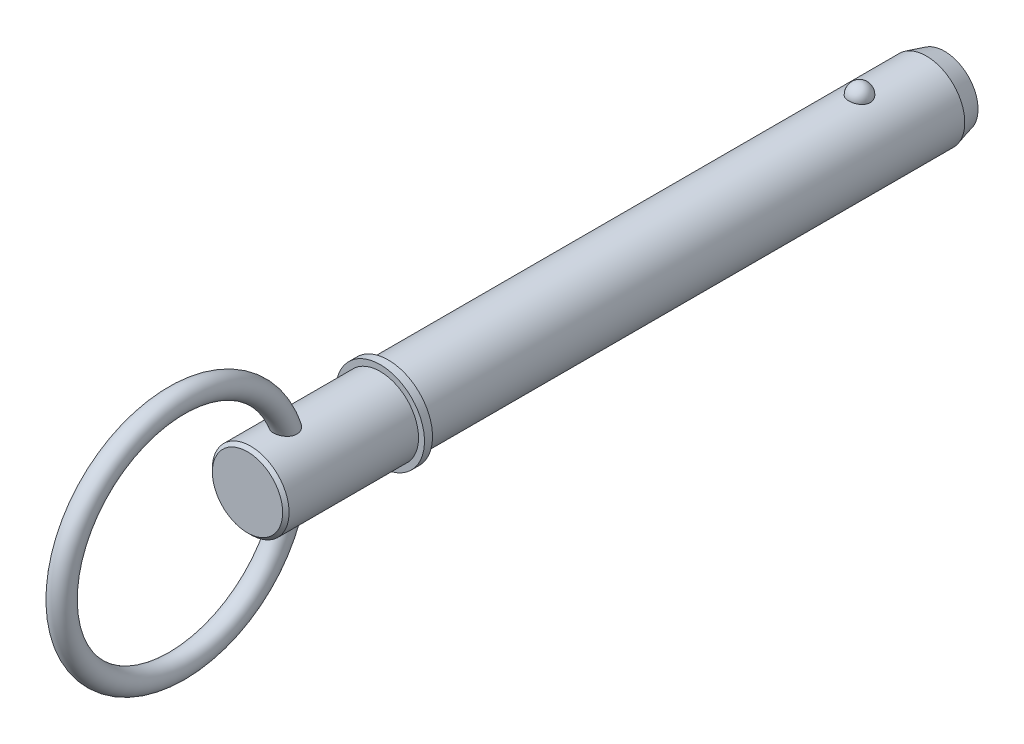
from build123d import *

# Parameters (mm, degrees)
SKETCH2_R           = 9.525
BOSS_EXTRUDE1_DEPTH = 114.3
BOSS_EXTRUDE2_START = 23.8
SKETCH3_R           = 9.525
BOSS_EXTRUDE2_DEPTH = 23.8
CHAMFER1_SIZE       = 4.5
CHAMFER1_SIZE2      = 1.205771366
SKETCH20_W          = 2
SKETCH20_H          = 11
SKETCH21_R          = 9.525
BOSS_EXTRUDE3_DEPTH = 34.93
CHAMFER2_SIZE       = 0.8
SKETCH24_R          = 2.75


with BuildPart() as part:
    # Sketch2 → Boss-Extrude1 (new body)
    with BuildSketch(Plane.XY):
        Circle(SKETCH2_R)
    extrude(amount=BOSS_EXTRUDE1_DEPTH)

    # Sketch3 → Boss-Extrude2 (add)
    with BuildSketch(Plane(origin=(0, 0, 0), x_dir=(-1, 0, 0), z_dir=(0, 0, -1)).offset(BOSS_EXTRUDE2_START)):
        Circle(SKETCH3_R)
    extrude(amount=-BOSS_EXTRUDE2_DEPTH)

    # Chamfer1
    chamfer1_edges = [part.edges().sort_by_distance(p)[0] for p in [
        (9.525, 0, -23.8),
    ]]
    chamfer1_side = [part.faces().sort_by_distance(p)[0] for p in [
        (9.525, 0, -11.9),
    ]]
    chamfer(chamfer1_edges, length=CHAMFER1_SIZE, length2=CHAMFER1_SIZE2, reference=chamfer1_side[0])

    # Sketch18 → Revolve1 (revolve)
    with BuildSketch(Plane(origin=(0, 0, 0), x_dir=(0, 0, -1), z_dir=(1, 0, 0))):
        with BuildLine():
            Line((2.69, 12.215), (2.69, 6.835))
            ThreePointArc((2.69, 6.835), (0, 9.525), (2.69, 12.215))
        make_face()
    revolve(axis=Axis((0, 12.215, -2.69), (0, -1, 0)))

    # Sketch20 → Revolve2 (revolve)
    with BuildSketch(Plane(origin=(0, 0, 0), x_dir=(0, 0, -1), z_dir=(1, 0, 0)), mode=Mode.PRIVATE) as revolve2_sk:
        with Locations((-115.3, 5.5)):
            Rectangle(SKETCH20_W, SKETCH20_H)
    revolve(revolve2_sk.sketch.rotate(Axis((0, 0, 33.728787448), (0, 0, 1)), 90), axis=Axis((0, 0, 33.728787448), (0, 0, 1)))

    # Sketch21 → Boss-Extrude3 (add)
    with BuildSketch(Plane(origin=(0, 0, 114.3), x_dir=(-1, 0, 0), z_dir=(0, 0, -1))):
        Circle(SKETCH21_R)
    extrude(amount=-BOSS_EXTRUDE3_DEPTH)

    # Chamfer2
    chamfer2_edges = [part.edges().sort_by_distance(p)[0] for p in [
        (9.525, 0, 149.23),
    ]]
    chamfer(chamfer2_edges, length=CHAMFER2_SIZE)

    # Sweep1: sweep along a path in Sketch23
    with BuildLine(Plane(origin=(0, 0, 0), x_dir=(0, 0, -1), z_dir=(1, 0, 0))) as sweep1_path:
        CenterArc((-166.805, 0), 28.575, 0, 360)
    # Sketch24 → Sweep1 (sweep)
    with BuildSketch(Plane(origin=(0, 0, 0), x_dir=(1, 0, 0), z_dir=(0, 1, 0))):
        with Locations((0, -138.23)):
            Circle(SKETCH24_R)
    sweep(path=sweep1_path.line)


solid = part.part
